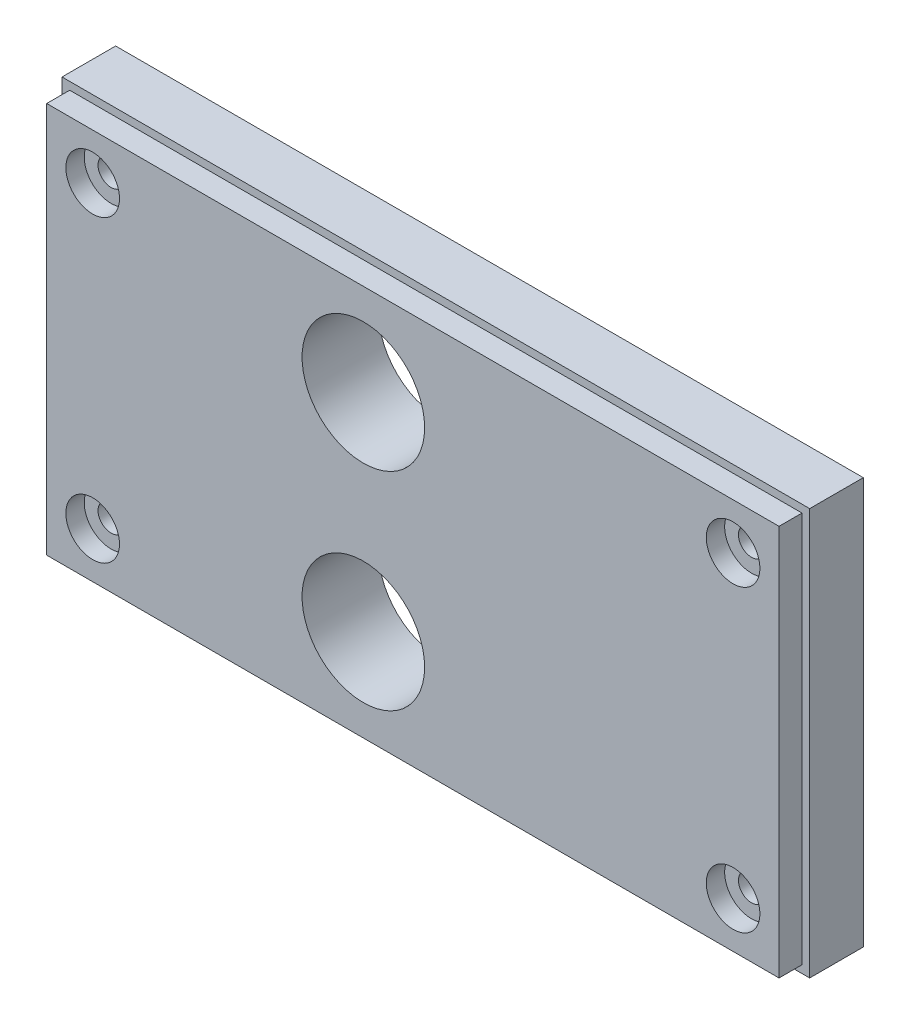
from build123d import *

# Parameters (mm, degrees)
SZKIC1_W                                          = 97.609566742
SZKIC1_H                                          = 53.07179677
DODANIE_WYCI_GNI_CIE1_DEPTH                       = 7
SZKIC2_W                                          = 95.609566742
SZKIC2_H                                          = 51.07179677
DODANIE_WYCI_GNI_CIE2_DEPTH                       = 3
POG_BIENIE_WALCOWE_POD_M3_RUB_Z_BEM_S_D           = 3.4
POG_BIENIE_WALCOWE_POD_M3_RUB_Z_BEM_S_CBORE_D     = 7
POG_BIENIE_WALCOWE_POD_M3_RUB_Z_BEM_S_CBORE_DEPTH = 2.4
LUSTRO2_COPY_1_D                                  = 3.4
LUSTRO2_COPY_1_CBORE_D                            = 7
LUSTRO2_COPY_1_CBORE_DEPTH                        = 2.4
WYTNIJ_WYCI_GNI_CIE1_REACH                        = 153.188
SZKIC5_R                                          = 8


with BuildPart() as part:
    # Szkic1 → Dodanie-wyci_gni_cie1 (new body)
    with BuildSketch(Plane.XY):
        with Locations((81.195216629, -50)):
            Rectangle(SZKIC1_W, SZKIC1_H)
    extrude(amount=DODANIE_WYCI_GNI_CIE1_DEPTH)

    # Szkic2 → Dodanie-wyci_gni_cie2 (add)
    with BuildSketch(Plane.XY.offset(7)):
        with Locations((81.195216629, -50)):
            Rectangle(SZKIC2_W, SZKIC2_H)
    extrude(amount=DODANIE_WYCI_GNI_CIE2_DEPTH)

    # Pog_bienie walcowe pod M3 _rub_ z _bem s (through all)
    with Locations(Plane(origin=(39.390433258, -30.464101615, 10), x_dir=(1, 0, 0), z_dir=(0, 0, 1))):
        with Locations((0, 0)):
            pog_bienie_walcowe_pod_m3_rub_z_bem_s = CounterBoreHole(POG_BIENIE_WALCOWE_POD_M3_RUB_Z_BEM_S_D / 2, POG_BIENIE_WALCOWE_POD_M3_RUB_Z_BEM_S_CBORE_D / 2, POG_BIENIE_WALCOWE_POD_M3_RUB_Z_BEM_S_CBORE_DEPTH)

    # Lustro1: Pog_bienie walcowe pod M3 _rub_ z _bem s across plane
    add(pog_bienie_walcowe_pod_m3_rub_z_bem_s.mirror(Plane.ZX.offset(-50)), mode=Mode.SUBTRACT)

    # Lustro2: Pog_bienie walcowe pod M3 _rub_ z _bem s across plane
    add(pog_bienie_walcowe_pod_m3_rub_z_bem_s.mirror(Plane.ZY.offset(-81.195216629)), mode=Mode.SUBTRACT)

    # Lustro2 copy 1 (through all)
    with Locations(Plane(origin=(123, -69.535898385, 10), x_dir=(-1, 0, 0), z_dir=(0, 0, 1))):
        with Locations((0, 0)):
            CounterBoreHole(LUSTRO2_COPY_1_D / 2, LUSTRO2_COPY_1_CBORE_D / 2, LUSTRO2_COPY_1_CBORE_DEPTH)

    # Szkic5 → Wytnij-wyci_gni_cie1 (cut, up to next)
    with BuildSketch(Plane.XY.offset(10), mode=Mode.PRIVATE) as wytnij_wyci_gni_cie1_sk1:
        with Locations((74.728578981, -36.464101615)):
            Circle(SZKIC5_R)
    wytnij_wyci_gni_cie1_tool1 = extrude(wytnij_wyci_gni_cie1_sk1.sketch, amount=-WYTNIJ_WYCI_GNI_CIE1_REACH, mode=Mode.PRIVATE) & part.part
    # Szkic5 → Wytnij-wyci_gni_cie1 (cut, up to next)
    with BuildSketch(Plane.XY.offset(10), mode=Mode.PRIVATE) as wytnij_wyci_gni_cie1_sk2:
        with Locations((74.728578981, -63.535898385)):
            Circle(SZKIC5_R)
    wytnij_wyci_gni_cie1_tool2 = extrude(wytnij_wyci_gni_cie1_sk2.sketch, amount=-WYTNIJ_WYCI_GNI_CIE1_REACH, mode=Mode.PRIVATE) & part.part
    add(wytnij_wyci_gni_cie1_tool1.solids().sort_by_distance((74.728579, -36.464102, 10))[0], mode=Mode.SUBTRACT)
    add(wytnij_wyci_gni_cie1_tool2.solids().sort_by_distance((74.728579, -63.535898, 10))[0], mode=Mode.SUBTRACT)


solid = part.part
